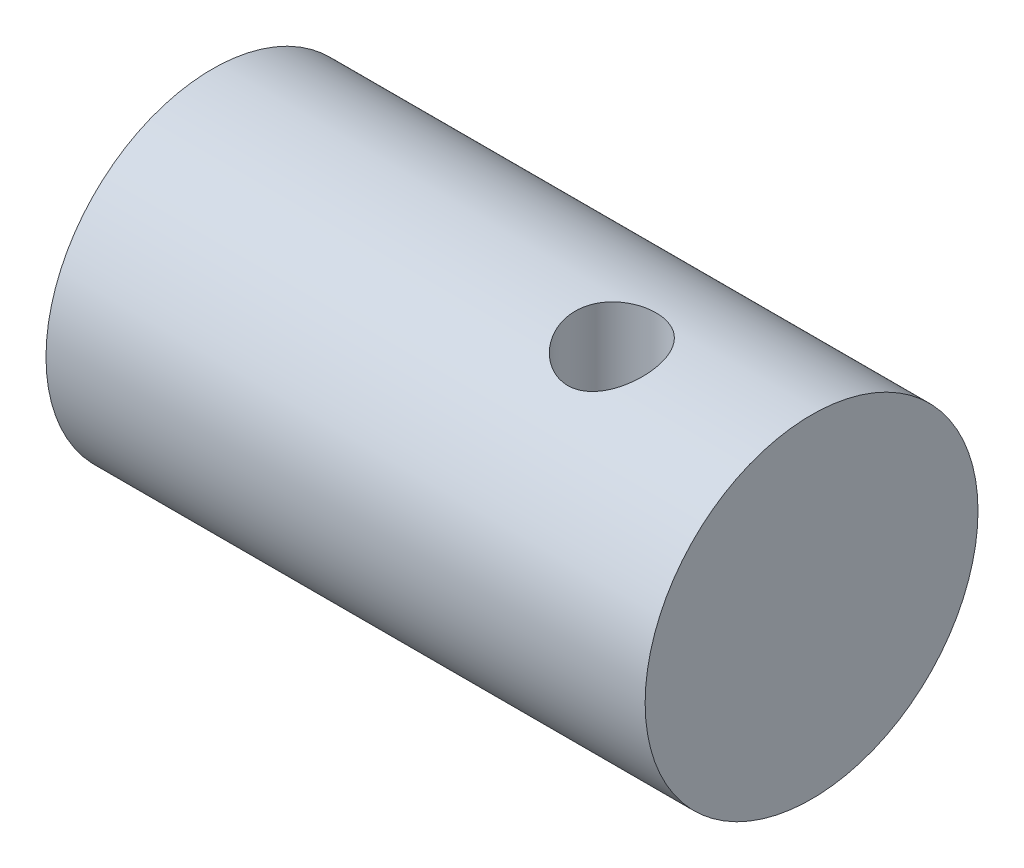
ISO-10303-21;
HEADER;
FILE_DESCRIPTION(('STEP AP214'),'2;1');
FILE_NAME('part.step','',(''),(''),'','','');
FILE_SCHEMA(('AUTOMOTIVE_DESIGN { 1 0 10303 214 1 1 1 1 }'));
ENDSEC;
DATA;
#1=APPLICATION_CONTEXT('core data for automotive mechanical design processes');
#2=APPLICATION_PROTOCOL_DEFINITION('international standard','automotive_design',2000,#1);
#3=PRODUCT_CONTEXT('',#1,'mechanical');
#4=PRODUCT('Part','Part','',(#3));
#5=PRODUCT_RELATED_PRODUCT_CATEGORY('part','',(#4));
#6=PRODUCT_DEFINITION_FORMATION('','',#4);
#7=PRODUCT_DEFINITION_CONTEXT('part definition',#1,'design');
#8=PRODUCT_DEFINITION('design','',#6,#7);
#9=PRODUCT_DEFINITION_SHAPE('','',#8);
#10=(LENGTH_UNIT() NAMED_UNIT(*) SI_UNIT(.MILLI.,.METRE.));
#11=(NAMED_UNIT(*) PLANE_ANGLE_UNIT() SI_UNIT($,.RADIAN.));
#12=(NAMED_UNIT(*) SI_UNIT($,.STERADIAN.) SOLID_ANGLE_UNIT());
#13=UNCERTAINTY_MEASURE_WITH_UNIT(LENGTH_MEASURE(1.E-05),#10,'distance_accuracy_value','');
#14=(GEOMETRIC_REPRESENTATION_CONTEXT(3) GLOBAL_UNCERTAINTY_ASSIGNED_CONTEXT((#13)) GLOBAL_UNIT_ASSIGNED_CONTEXT((#10,
#11,#12)) REPRESENTATION_CONTEXT('',''));
#15=CARTESIAN_POINT('',(0.,0.,0.));
#16=DIRECTION('',(0.,0.,1.));
#17=DIRECTION('',(1.,0.,0.));
#18=AXIS2_PLACEMENT_3D('',#15,#16,#17);
#19=CARTESIAN_POINT('',(0.,0.,0.));
#20=DIRECTION('',(-1.,0.,0.));
#21=DIRECTION('',(0.,0.,1.));
#22=AXIS2_PLACEMENT_3D('',#19,#20,#21);
#23=PLANE('',#22);
#24=CARTESIAN_POINT('',(0.,0.,0.));
#25=DIRECTION('',(-1.,0.,0.));
#26=DIRECTION('',(0.,0.,1.));
#27=AXIS2_PLACEMENT_3D('',#24,#25,#26);
#28=CIRCLE('',#27,15.875);
#29=CARTESIAN_POINT('',(0.,0.,15.875));
#30=VERTEX_POINT('',#29);
#31=EDGE_CURVE('E10',#30,#30,#28,.T.);
#32=ORIENTED_EDGE('',*,*,#31,.F.);
#33=EDGE_LOOP('',(#32));
#34=FACE_BOUND('',#33,.T.);
#35=ADVANCED_FACE('F29',(#34),#23,.F.);
#36=CARTESIAN_POINT('',(0.,0.,0.));
#37=DIRECTION('',(-1.,0.,0.));
#38=DIRECTION('',(0.,0.,1.));
#39=AXIS2_PLACEMENT_3D('',#36,#37,#38);
#40=CYLINDRICAL_SURFACE('',#39,15.875);
#41=CARTESIAN_POINT('',(-18.6494195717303,-15.875,0.));
#42=CARTESIAN_POINT('',(-18.8247307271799,-15.8749980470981,0.153198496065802));
#43=CARTESIAN_POINT('',(-18.987363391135,-15.8727779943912,0.320984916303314));
#44=CARTESIAN_POINT('',(-19.2826641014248,-15.8614077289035,0.680991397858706));
#45=CARTESIAN_POINT('',(-19.4153246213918,-15.8522557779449,0.873217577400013));
#46=CARTESIAN_POINT('',(-19.6469879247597,-15.8248830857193,1.27652039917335));
#47=CARTESIAN_POINT('',(-19.7459771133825,-15.8066586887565,1.4876046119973));
#48=CARTESIAN_POINT('',(-19.9076228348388,-15.7597203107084,1.92211926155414));
#49=CARTESIAN_POINT('',(-19.9702841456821,-15.73100770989,2.14554807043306));
#50=CARTESIAN_POINT('',(-20.0577654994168,-15.6628924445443,2.5963435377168));
#51=CARTESIAN_POINT('',(-20.0828590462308,-15.6235695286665,2.82366942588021));
#52=CARTESIAN_POINT('',(-20.0962656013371,-15.5347299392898,3.27738575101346));
#53=CARTESIAN_POINT('',(-20.0845741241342,-15.4852120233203,3.50377607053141));
#54=CARTESIAN_POINT('',(-20.0250083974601,-15.3762241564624,3.95506346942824));
#55=CARTESIAN_POINT('',(-19.9762771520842,-15.3165448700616,4.17979592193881));
#56=CARTESIAN_POINT('',(-19.8438292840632,-15.1905624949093,4.61673181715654));
#57=CARTESIAN_POINT('',(-19.760102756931,-15.1242575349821,4.82893169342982));
#58=CARTESIAN_POINT('',(-19.5545527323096,-14.9842601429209,5.24776465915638));
#59=CARTESIAN_POINT('',(-19.430842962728,-14.9103619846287,5.45340472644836));
#60=CARTESIAN_POINT('',(-19.1503777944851,-14.762863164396,5.84093940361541));
#61=CARTESIAN_POINT('',(-18.9936083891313,-14.6892626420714,6.02282389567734));
#62=CARTESIAN_POINT('',(-18.6440829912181,-14.5446367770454,6.36433336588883));
#63=CARTESIAN_POINT('',(-18.4502595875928,-14.4737917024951,6.52295656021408));
#64=CARTESIAN_POINT('',(-18.1390366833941,-14.3760962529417,6.73420722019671));
#65=CARTESIAN_POINT('',(-18.0318239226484,-14.3449467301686,6.800202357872));
#66=CARTESIAN_POINT('',(-17.8111855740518,-14.2862427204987,6.9226796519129));
#67=CARTESIAN_POINT('',(-17.6977633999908,-14.2586862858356,6.97916696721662));
#68=CARTESIAN_POINT('',(-17.4715546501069,-14.209227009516,7.07929741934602));
#69=CARTESIAN_POINT('',(-17.3590447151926,-14.1871039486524,7.12345757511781));
#70=CARTESIAN_POINT('',(-17.1299840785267,-14.1473331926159,7.20211996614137));
#71=CARTESIAN_POINT('',(-17.013435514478,-14.1296831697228,7.23662722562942));
#72=CARTESIAN_POINT('',(-16.7772478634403,-14.0993595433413,7.29553185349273));
#73=CARTESIAN_POINT('',(-16.6576106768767,-14.0866829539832,7.31993528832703));
#74=CARTESIAN_POINT('',(-16.4162354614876,-14.0666797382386,7.35830265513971));
#75=CARTESIAN_POINT('',(-16.2944976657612,-14.0593525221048,7.37226773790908));
#76=CARTESIAN_POINT('',(-16.063224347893,-14.050766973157,7.38861584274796));
#77=CARTESIAN_POINT('',(-15.9537850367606,-14.0489405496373,7.39208324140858));
#78=CARTESIAN_POINT('',(-15.7349482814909,-14.0497765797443,7.39049419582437));
#79=CARTESIAN_POINT('',(-15.625550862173,-14.0524404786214,7.38543500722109));
#80=CARTESIAN_POINT('',(-15.4077259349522,-14.0621915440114,7.3668518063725));
#81=CARTESIAN_POINT('',(-15.2992979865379,-14.0692765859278,7.3533318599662));
#82=CARTESIAN_POINT('',(-15.0841522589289,-14.0876827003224,7.31800563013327));
#83=CARTESIAN_POINT('',(-14.9774351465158,-14.0990053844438,7.29619619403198));
#84=CARTESIAN_POINT('',(-14.6683232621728,-14.1380233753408,7.22046698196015));
#85=CARTESIAN_POINT('',(-14.4691834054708,-14.1711551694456,7.15554227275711));
#86=CARTESIAN_POINT('',(-14.0848220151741,-14.2495287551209,6.9981577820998));
#87=CARTESIAN_POINT('',(-13.8996040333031,-14.2947736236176,6.90569100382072));
#88=CARTESIAN_POINT('',(-13.5331085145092,-14.397904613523,6.68816003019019));
#89=CARTESIAN_POINT('',(-13.3531691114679,-14.4564844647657,6.56117071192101));
#90=CARTESIAN_POINT('',(-13.0163695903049,-14.5799155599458,6.28211444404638));
#91=CARTESIAN_POINT('',(-12.8595205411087,-14.644769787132,6.13003554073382));
#92=CARTESIAN_POINT('',(-12.5570061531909,-14.7836233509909,5.7877023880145));
#93=CARTESIAN_POINT('',(-12.4140578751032,-14.8578859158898,5.59514597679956));
#94=CARTESIAN_POINT('',(-12.1625261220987,-15.0048462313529,5.18816189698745));
#95=CARTESIAN_POINT('',(-12.0539522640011,-15.0775435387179,4.97372812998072));
#96=CARTESIAN_POINT('',(-11.8712566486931,-15.2197542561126,4.52028598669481));
#97=CARTESIAN_POINT('',(-11.7984357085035,-15.2890746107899,4.28068902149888));
#98=CARTESIAN_POINT('',(-11.6961609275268,-15.418059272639,3.78990133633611));
#99=CARTESIAN_POINT('',(-11.6666934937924,-15.4777266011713,3.53871427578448));
#100=CARTESIAN_POINT('',(-11.6537012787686,-15.5824574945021,3.04365541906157));
#101=CARTESIAN_POINT('',(-11.6682126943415,-15.6280479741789,2.79994783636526));
#102=CARTESIAN_POINT('',(-11.7396519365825,-15.7069375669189,2.31680710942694));
#103=CARTESIAN_POINT('',(-11.7965657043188,-15.7402407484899,2.07737257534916));
#104=CARTESIAN_POINT('',(-11.9476369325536,-15.7933672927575,1.62319565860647));
#105=CARTESIAN_POINT('',(-12.0396729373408,-15.813808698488,1.40781698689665));
#106=CARTESIAN_POINT('',(-12.2584885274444,-15.8451579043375,0.994751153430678));
#107=CARTESIAN_POINT('',(-12.3852661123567,-15.8560662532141,0.797062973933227));
#108=CARTESIAN_POINT('',(-12.6683560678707,-15.8703120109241,0.427447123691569));
#109=CARTESIAN_POINT('',(-12.824312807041,-15.8737348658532,0.255249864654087));
#110=CARTESIAN_POINT('',(-13.162371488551,-15.8756724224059,-0.0612475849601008));
#111=CARTESIAN_POINT('',(-13.3444753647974,-15.8741867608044,-0.205545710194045));
#112=CARTESIAN_POINT('',(-13.732767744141,-15.8687476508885,-0.464245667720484));
#113=CARTESIAN_POINT('',(-13.939277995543,-15.8647573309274,-0.578163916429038));
#114=CARTESIAN_POINT('',(-14.3683751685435,-15.8566052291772,-0.770041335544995));
#115=CARTESIAN_POINT('',(-14.5909625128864,-15.8524434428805,-0.847999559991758));
#116=CARTESIAN_POINT('',(-15.0480080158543,-15.8456770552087,-0.966293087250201));
#117=CARTESIAN_POINT('',(-15.2825520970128,-15.8430862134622,-1.00629763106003));
#118=CARTESIAN_POINT('',(-15.7550589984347,-15.8404916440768,-1.04635777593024));
#119=CARTESIAN_POINT('',(-15.9930220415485,-15.8404880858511,-1.04641076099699));
#120=CARTESIAN_POINT('',(-16.4651666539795,-15.843066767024,-1.00659969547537));
#121=CARTESIAN_POINT('',(-16.6993537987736,-15.8456447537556,-0.966801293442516));
#122=CARTESIAN_POINT('',(-17.1576633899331,-15.8524164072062,-0.848527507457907));
#123=CARTESIAN_POINT('',(-17.3817892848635,-15.8566095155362,-0.770065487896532));
#124=CARTESIAN_POINT('',(-17.7884029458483,-15.8643323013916,-0.588057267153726));
#125=CARTESIAN_POINT('',(-17.9726955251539,-15.8678822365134,-0.488515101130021));
#126=CARTESIAN_POINT('',(-18.3245356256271,-15.873216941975,-0.26323149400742));
#127=CARTESIAN_POINT('',(-18.4920835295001,-15.8750017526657,-0.137490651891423));
#128=CARTESIAN_POINT('',(-18.6494195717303,-15.875,0.));
#129=B_SPLINE_CURVE_WITH_KNOTS('',3,(#41,#42,#43,#44,#45,#46,#47,#48,#49,#50,#51,#52,#53,#54,
#55,#56,#57,#58,#59,#60,#61,#62,#63,#64,#65,#66,#67,#68,#69,#70,#71,#72,#73,#74,#75,#76,#77,#78,
#79,#80,#81,#82,#83,#84,#85,#86,#87,#88,#89,#90,#91,#92,#93,#94,#95,#96,#97,#98,#99,#100,#101,
#102,#103,#104,#105,#106,#107,#108,#109,#110,#111,#112,#113,#114,#115,#116,#117,#118,#119,#120,
#121,#122,#123,#124,#125,#126,#127,#128),.UNSPECIFIED.,.T.,.F.,(4,2,2,2,2,2,2,2,2,2,2,2,2,2,2,2,
2,2,2,2,2,2,2,2,2,2,2,2,2,2,2,2,2,2,2,2,2,2,2,2,2,2,2,4),(0.,0.697719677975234,1.3956143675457,
2.09379049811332,2.79187478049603,3.48485166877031,4.17791306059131,4.8875173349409,
5.59732258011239,6.34725832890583,7.09751245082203,7.87402315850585,8.26265688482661,
8.65107905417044,9.01919919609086,9.38712737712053,9.75483432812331,10.122500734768,
10.4506134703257,10.7788318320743,11.1068925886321,11.435078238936,12.0682705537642,
12.7016238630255,13.3824936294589,14.0636887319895,14.8134855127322,15.5634918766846,
16.3390689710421,17.1144028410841,17.8556331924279,18.5966178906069,19.2985416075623,
20.000424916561,20.6942535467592,21.388133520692,22.0924758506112,22.7968367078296,
23.5072810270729,24.2177718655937,24.9270942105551,25.6361715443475,26.2623665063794,
26.8885471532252),.UNSPECIFIED.);
#130=CARTESIAN_POINT('',(-18.6494195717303,-15.875,0.));
#131=VERTEX_POINT('',#130);
#132=EDGE_CURVE('E64',#131,#131,#129,.T.);
#133=ORIENTED_EDGE('',*,*,#132,.T.);
#134=EDGE_LOOP('',(#133));
#135=FACE_BOUND('',#134,.T.);
#136=CARTESIAN_POINT('',(-15.875,14.0493000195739,7.3914));
#137=CARTESIAN_POINT('',(-15.985142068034,14.0492955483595,7.39140494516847));
#138=CARTESIAN_POINT('',(-16.0952416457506,14.0515734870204,7.38708258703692));
#139=CARTESIAN_POINT('',(-16.3146140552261,14.0606143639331,7.36986134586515));
#140=CARTESIAN_POINT('',(-16.4238867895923,14.0673778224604,7.35696146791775));
#141=CARTESIAN_POINT('',(-16.64077955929,14.0852267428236,7.32273049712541));
#142=CARTESIAN_POINT('',(-16.748399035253,14.0963136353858,7.30139661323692));
#143=CARTESIAN_POINT('',(-16.9612026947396,14.1225291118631,7.25055906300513));
#144=CARTESIAN_POINT('',(-17.0663858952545,14.1376592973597,7.22105215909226));
#145=CARTESIAN_POINT('',(-17.3763808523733,14.1884748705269,7.12098611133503));
#146=CARTESIAN_POINT('',(-17.5766529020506,14.22967371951,7.03871807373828));
#147=CARTESIAN_POINT('',(-17.9600876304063,14.3233602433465,6.84604881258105));
#148=CARTESIAN_POINT('',(-18.1432466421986,14.3758503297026,6.73564157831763));
#149=CARTESIAN_POINT('',(-18.5001258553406,14.4919749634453,6.48219593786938));
#150=CARTESIAN_POINT('',(-18.6725468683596,14.5561001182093,6.33755298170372));
#151=CARTESIAN_POINT('',(-18.9914951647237,14.6887241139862,6.02378819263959));
#152=CARTESIAN_POINT('',(-19.1380118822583,14.7572247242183,5.85465642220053));
#153=CARTESIAN_POINT('',(-19.4145756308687,14.9009933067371,5.47904985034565));
#154=CARTESIAN_POINT('',(-19.541894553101,14.9763077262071,5.27057499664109));
#155=CARTESIAN_POINT('',(-19.7591331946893,15.122985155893,4.83363541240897));
#156=CARTESIAN_POINT('',(-19.8490474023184,15.1943475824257,4.60516774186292));
#157=CARTESIAN_POINT('',(-19.988915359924,15.3299087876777,4.13166676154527));
#158=CARTESIAN_POINT('',(-20.0384826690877,15.394033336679,3.88649707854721));
#159=CARTESIAN_POINT('',(-20.0934132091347,15.5112157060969,3.38867176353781));
#160=CARTESIAN_POINT('',(-20.0987941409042,15.5642779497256,3.13601916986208));
#161=CARTESIAN_POINT('',(-20.0648125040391,15.6549522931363,2.64518740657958));
#162=CARTESIAN_POINT('',(-20.0278628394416,15.6932467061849,2.40696703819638));
#163=CARTESIAN_POINT('',(-19.9133105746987,15.7579292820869,1.9388388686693));
#164=CARTESIAN_POINT('',(-19.8357181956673,15.7843204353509,1.70892899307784));
#165=CARTESIAN_POINT('',(-19.6460374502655,15.8251765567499,1.27474075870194));
#166=CARTESIAN_POINT('',(-19.5356026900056,15.8401118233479,1.06978163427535));
#167=CARTESIAN_POINT('',(-19.282281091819,15.8616059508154,0.680529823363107));
#168=CARTESIAN_POINT('',(-19.1393944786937,15.8681648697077,0.49623699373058));
#169=CARTESIAN_POINT('',(-18.8253126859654,15.8751800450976,0.153804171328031));
#170=CARTESIAN_POINT('',(-18.6541428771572,15.8756417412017,-0.00435900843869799));
#171=CARTESIAN_POINT('',(-18.2881344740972,15.8729903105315,-0.290366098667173));
#172=CARTESIAN_POINT('',(-18.093294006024,15.8698769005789,-0.418207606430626));
#173=CARTESIAN_POINT('',(-17.6820133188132,15.8624216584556,-0.641855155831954));
#174=CARTESIAN_POINT('',(-17.4652797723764,15.8580611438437,-0.737121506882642));
#175=CARTESIAN_POINT('',(-17.0189278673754,15.8502124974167,-0.890110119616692));
#176=CARTESIAN_POINT('',(-16.7893093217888,15.8467243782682,-0.947831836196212));
#177=CARTESIAN_POINT('',(-16.3225077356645,15.8419687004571,-1.02428155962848));
#178=CARTESIAN_POINT('',(-16.0852937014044,15.8407118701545,-1.04282125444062));
#179=CARTESIAN_POINT('',(-15.6111230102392,15.8409098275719,-1.03980850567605));
#180=CARTESIAN_POINT('',(-15.3741663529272,15.8423646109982,-1.01825612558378));
#181=CARTESIAN_POINT('',(-14.9077246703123,15.8474492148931,-0.935765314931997));
#182=CARTESIAN_POINT('',(-14.6782257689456,15.8510747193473,-0.874905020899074));
#183=CARTESIAN_POINT('',(-14.2326713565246,15.8590623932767,-0.715599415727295));
#184=CARTESIAN_POINT('',(-14.0166164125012,15.863424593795,-0.617152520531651));
#185=CARTESIAN_POINT('',(-13.6036071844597,15.8707492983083,-0.38519832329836));
#186=CARTESIAN_POINT('',(-13.4066930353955,15.8737089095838,-0.251619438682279));
#187=CARTESIAN_POINT('',(-13.0380745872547,15.8756299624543,0.0467262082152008));
#188=CARTESIAN_POINT('',(-12.8663694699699,15.8745915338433,0.211491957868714));
#189=CARTESIAN_POINT('',(-12.5538481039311,15.8658723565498,0.566616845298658));
#190=CARTESIAN_POINT('',(-12.4128937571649,15.8582221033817,0.756855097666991));
#191=CARTESIAN_POINT('',(-12.1649584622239,15.8339954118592,1.15778560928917));
#192=CARTESIAN_POINT('',(-12.0579722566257,15.8174203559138,1.36847469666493));
#193=CARTESIAN_POINT('',(-11.8822917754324,15.7740553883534,1.80030639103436));
#194=CARTESIAN_POINT('',(-11.8130138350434,15.7474326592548,2.02122860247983));
#195=CARTESIAN_POINT('',(-11.7116180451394,15.6833220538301,2.46989132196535));
#196=CARTESIAN_POINT('',(-11.679499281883,15.645834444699,2.69763166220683));
#197=CARTESIAN_POINT('',(-11.6524754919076,15.5603813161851,3.15340225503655));
#198=CARTESIAN_POINT('',(-11.6575853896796,15.5124116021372,3.38143258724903));
#199=CARTESIAN_POINT('',(-11.7038969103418,15.4073902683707,3.83163557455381));
#200=CARTESIAN_POINT('',(-11.7451052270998,15.3503369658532,4.05380713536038));
#201=CARTESIAN_POINT('',(-11.864016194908,15.2268883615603,4.49580542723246));
#202=CARTESIAN_POINT('',(-11.9431316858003,15.160207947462,4.71517129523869));
#203=CARTESIAN_POINT('',(-12.1356418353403,15.0225600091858,5.1368852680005));
#204=CARTESIAN_POINT('',(-12.2490485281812,14.9515909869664,5.33922736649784));
#205=CARTESIAN_POINT('',(-12.514604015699,14.8050803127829,5.73340324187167));
#206=CARTESIAN_POINT('',(-12.6685832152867,14.729507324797,5.92399286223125));
#207=CARTESIAN_POINT('',(-13.0084120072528,14.582697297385,6.27671040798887));
#208=CARTESIAN_POINT('',(-13.1942742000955,14.5114619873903,6.43882702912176));
#209=CARTESIAN_POINT('',(-13.4941637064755,14.4119737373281,6.65711059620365));
#210=CARTESIAN_POINT('',(-13.5979819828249,14.3799546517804,6.72588961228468));
#211=CARTESIAN_POINT('',(-13.8119861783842,14.3191712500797,6.85434133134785));
#212=CARTESIAN_POINT('',(-13.9221690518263,14.2904053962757,6.91401834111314));
#213=CARTESIAN_POINT('',(-14.1480892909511,14.236878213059,7.02357793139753));
#214=CARTESIAN_POINT('',(-14.2638206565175,14.2121126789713,7.07347080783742));
#215=CARTESIAN_POINT('',(-14.5000360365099,14.1672433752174,7.16291391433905));
#216=CARTESIAN_POINT('',(-14.6205186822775,14.1471382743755,7.2024670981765));
#217=CARTESIAN_POINT('',(-14.925791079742,14.1035697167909,7.28754311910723));
#218=CARTESIAN_POINT('',(-15.1129709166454,14.08334621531,7.32637737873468));
#219=CARTESIAN_POINT('',(-15.4918109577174,14.0562173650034,7.37829743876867));
#220=CARTESIAN_POINT('',(-15.6834697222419,14.0493077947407,7.39139140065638));
#221=CARTESIAN_POINT('',(-15.875,14.0493000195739,7.3914));
#222=B_SPLINE_CURVE_WITH_KNOTS('',3,(#136,#137,#138,#139,#140,#141,#142,#143,#144,#145,#146,
#147,#148,#149,#150,#151,#152,#153,#154,#155,#156,#157,#158,#159,#160,#161,#162,#163,#164,#165,
#166,#167,#168,#169,#170,#171,#172,#173,#174,#175,#176,#177,#178,#179,#180,#181,#182,#183,#184,
#185,#186,#187,#188,#189,#190,#191,#192,#193,#194,#195,#196,#197,#198,#199,#200,#201,#202,#203,
#204,#205,#206,#207,#208,#209,#210,#211,#212,#213,#214,#215,#216,#217,#218,#219,#220,#221),
.UNSPECIFIED.,.T.,.F.,(4,2,2,2,2,2,2,2,2,2,2,2,2,2,2,2,2,2,2,2,2,2,2,2,2,2,2,2,2,2,2,2,2,2,2,2,
2,2,2,2,2,2,4),(0.,0.33024455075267,0.660527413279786,0.990919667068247,1.32144298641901,
1.97943346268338,2.63756460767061,3.33670256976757,4.03612504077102,4.79945507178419,
5.56289754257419,6.33356892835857,7.10393157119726,7.83247752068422,8.56084033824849,
9.25740980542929,9.95397444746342,10.6499176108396,11.3459159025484,12.0529421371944,
12.7599786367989,13.4704055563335,14.1808313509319,14.889849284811,15.5988971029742,
16.3094009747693,17.019881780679,17.7271030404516,18.4342147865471,19.1300455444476,
19.8258591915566,20.5219517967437,21.2181735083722,21.9426428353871,22.6673667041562,
23.4331353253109,24.1992072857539,24.5845324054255,24.9696746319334,25.3544093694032,
25.7390340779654,26.3134911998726,26.8877661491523),.UNSPECIFIED.);
#223=CARTESIAN_POINT('',(-15.875,14.0493000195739,7.3914));
#224=VERTEX_POINT('',#223);
#225=EDGE_CURVE('E69',#224,#224,#222,.T.);
#226=ORIENTED_EDGE('',*,*,#225,.T.);
#227=EDGE_LOOP('',(#226));
#228=FACE_BOUND('',#227,.T.);
#229=CARTESIAN_POINT('',(-57.15,0.,0.));
#230=DIRECTION('',(-1.,0.,0.));
#231=DIRECTION('',(0.,0.,1.));
#232=AXIS2_PLACEMENT_3D('',#229,#230,#231);
#233=CIRCLE('',#232,15.875);
#234=CARTESIAN_POINT('',(-57.15,0.,15.875));
#235=VERTEX_POINT('',#234);
#236=EDGE_CURVE('E40',#235,#235,#233,.T.);
#237=ORIENTED_EDGE('',*,*,#236,.F.);
#238=EDGE_LOOP('',(#237));
#239=FACE_BOUND('',#238,.T.);
#240=ORIENTED_EDGE('',*,*,#31,.T.);
#241=EDGE_LOOP('',(#240));
#242=FACE_BOUND('',#241,.T.);
#243=ADVANCED_FACE('F72',(#135,#228,#239,#242),#40,.T.);
#244=CARTESIAN_POINT('',(-57.15,15.875,0.));
#245=DIRECTION('',(1.,0.,0.));
#246=DIRECTION('',(0.,0.,-1.));
#247=AXIS2_PLACEMENT_3D('',#244,#245,#246);
#248=PLANE('',#247);
#249=CARTESIAN_POINT('',(-57.15,0.,0.));
#250=DIRECTION('',(-1.,0.,0.));
#251=DIRECTION('',(0.,0.,1.));
#252=AXIS2_PLACEMENT_3D('',#249,#250,#251);
#253=CIRCLE('',#252,12.7);
#254=CARTESIAN_POINT('',(-57.15,0.,12.7));
#255=VERTEX_POINT('',#254);
#256=EDGE_CURVE('E44',#255,#255,#253,.T.);
#257=ORIENTED_EDGE('',*,*,#256,.F.);
#258=EDGE_LOOP('',(#257));
#259=FACE_BOUND('',#258,.T.);
#260=ORIENTED_EDGE('',*,*,#236,.T.);
#261=EDGE_LOOP('',(#260));
#262=FACE_BOUND('',#261,.T.);
#263=ADVANCED_FACE('F104',(#259,#262),#248,.F.);
#264=CARTESIAN_POINT('',(0.,0.,0.));
#265=DIRECTION('',(-1.,0.,0.));
#266=DIRECTION('',(0.,0.,1.));
#267=AXIS2_PLACEMENT_3D('',#264,#265,#266);
#268=CYLINDRICAL_SURFACE('',#267,12.7);
#269=CARTESIAN_POINT('',(-50.8,0.,0.));
#270=DIRECTION('',(-1.,0.,0.));
#271=DIRECTION('',(0.,0.,1.));
#272=AXIS2_PLACEMENT_3D('',#269,#270,#271);
#273=CIRCLE('',#272,12.7);
#274=CARTESIAN_POINT('',(-50.8,0.,12.7));
#275=VERTEX_POINT('',#274);
#276=EDGE_CURVE('E49',#275,#275,#273,.T.);
#277=ORIENTED_EDGE('',*,*,#276,.F.);
#278=EDGE_LOOP('',(#277));
#279=FACE_BOUND('',#278,.T.);
#280=ORIENTED_EDGE('',*,*,#256,.T.);
#281=EDGE_LOOP('',(#280));
#282=FACE_BOUND('',#281,.T.);
#283=ADVANCED_FACE('F101',(#279,#282),#268,.F.);
#284=CARTESIAN_POINT('',(-50.8,12.7,0.));
#285=DIRECTION('',(1.,0.,0.));
#286=DIRECTION('',(0.,0.,-1.));
#287=AXIS2_PLACEMENT_3D('',#284,#285,#286);
#288=PLANE('',#287);
#289=CARTESIAN_POINT('',(-50.8,0.,0.));
#290=DIRECTION('',(-1.,0.,0.));
#291=DIRECTION('',(0.,0.,1.));
#292=AXIS2_PLACEMENT_3D('',#289,#290,#291);
#293=CIRCLE('',#292,10.3124);
#294=CARTESIAN_POINT('',(-50.8,0.,10.3124));
#295=VERTEX_POINT('',#294);
#296=EDGE_CURVE('E52',#295,#295,#293,.T.);
#297=ORIENTED_EDGE('',*,*,#296,.F.);
#298=EDGE_LOOP('',(#297));
#299=FACE_BOUND('',#298,.T.);
#300=ORIENTED_EDGE('',*,*,#276,.T.);
#301=EDGE_LOOP('',(#300));
#302=FACE_BOUND('',#301,.T.);
#303=ADVANCED_FACE('F97',(#299,#302),#288,.F.);
#304=CARTESIAN_POINT('',(0.,0.,0.));
#305=DIRECTION('',(-1.,0.,0.));
#306=DIRECTION('',(0.,0.,1.));
#307=AXIS2_PLACEMENT_3D('',#304,#305,#306);
#308=CYLINDRICAL_SURFACE('',#307,10.3124);
#309=CARTESIAN_POINT('',(-31.75,0.,0.));
#310=DIRECTION('',(-1.,0.,0.));
#311=DIRECTION('',(0.,0.,1.));
#312=AXIS2_PLACEMENT_3D('',#309,#310,#311);
#313=CIRCLE('',#312,10.3124);
#314=CARTESIAN_POINT('',(-31.75,0.,10.3124));
#315=VERTEX_POINT('',#314);
#316=EDGE_CURVE('E55',#315,#315,#313,.T.);
#317=ORIENTED_EDGE('',*,*,#316,.F.);
#318=EDGE_LOOP('',(#317));
#319=FACE_BOUND('',#318,.T.);
#320=ORIENTED_EDGE('',*,*,#296,.T.);
#321=EDGE_LOOP('',(#320));
#322=FACE_BOUND('',#321,.T.);
#323=ADVANCED_FACE('F93',(#319,#322),#308,.F.);
#324=CARTESIAN_POINT('',(-31.75,10.3124,0.));
#325=DIRECTION('',(1.,0.,0.));
#326=DIRECTION('',(0.,0.,-1.));
#327=AXIS2_PLACEMENT_3D('',#324,#325,#326);
#328=PLANE('',#327);
#329=CARTESIAN_POINT('',(-31.75,0.,0.));
#330=DIRECTION('',(-1.,0.,0.));
#331=DIRECTION('',(0.,0.,1.));
#332=AXIS2_PLACEMENT_3D('',#329,#330,#331);
#333=CIRCLE('',#332,6.5405);
#334=CARTESIAN_POINT('',(-31.75,0.,6.5405));
#335=VERTEX_POINT('',#334);
#336=EDGE_CURVE('E58',#335,#335,#333,.T.);
#337=ORIENTED_EDGE('',*,*,#336,.F.);
#338=EDGE_LOOP('',(#337));
#339=FACE_BOUND('',#338,.T.);
#340=ORIENTED_EDGE('',*,*,#316,.T.);
#341=EDGE_LOOP('',(#340));
#342=FACE_BOUND('',#341,.T.);
#343=ADVANCED_FACE('F89',(#339,#342),#328,.F.);
#344=CARTESIAN_POINT('',(0.,0.,0.));
#345=DIRECTION('',(-1.,0.,0.));
#346=DIRECTION('',(0.,0.,1.));
#347=AXIS2_PLACEMENT_3D('',#344,#345,#346);
#348=CYLINDRICAL_SURFACE('',#347,6.5405);
#349=CARTESIAN_POINT('',(-13.3350317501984,0.,6.5405));
#350=CARTESIAN_POINT('',(-13.3350353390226,0.135417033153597,6.54050141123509));
#351=CARTESIAN_POINT('',(-13.3294168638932,0.270822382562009,6.53628396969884));
#352=CARTESIAN_POINT('',(-13.3074647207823,0.540289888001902,6.51954453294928));
#353=CARTESIAN_POINT('',(-13.2911257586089,0.674351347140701,6.50701843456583));
#354=CARTESIAN_POINT('',(-13.2490121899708,0.940450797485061,6.47392819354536));
#355=CARTESIAN_POINT('',(-13.2232029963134,1.07247949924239,6.45333456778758));
#356=CARTESIAN_POINT('',(-13.1639619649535,1.33339775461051,6.40451578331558));
#357=CARTESIAN_POINT('',(-13.1305264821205,1.46228577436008,6.37628697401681));
#358=CARTESIAN_POINT('',(-13.0435188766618,1.76702185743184,6.299944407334));
#359=CARTESIAN_POINT('',(-12.9872191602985,1.94122579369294,6.24838422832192));
#360=CARTESIAN_POINT('',(-12.8680171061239,2.28275933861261,6.13186256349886));
#361=CARTESIAN_POINT('',(-12.8051115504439,2.45008554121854,6.06689453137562));
#362=CARTESIAN_POINT('',(-12.6763393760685,2.77828531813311,5.92379766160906));
#363=CARTESIAN_POINT('',(-12.6104667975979,2.93914455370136,5.84564138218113));
#364=CARTESIAN_POINT('',(-12.4790462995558,3.25400353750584,5.67640174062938));
#365=CARTESIAN_POINT('',(-12.4134983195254,3.40800460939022,5.58532088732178));
#366=CARTESIAN_POINT('',(-12.282896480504,3.71502444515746,5.38623644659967));
#367=CARTESIAN_POINT('',(-12.2179697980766,3.86775163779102,5.27769746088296));
#368=CARTESIAN_POINT('',(-12.0944142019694,4.16494322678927,5.04646711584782));
#369=CARTESIAN_POINT('',(-12.0357869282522,4.30940546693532,4.92377208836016));
#370=CARTESIAN_POINT('',(-11.9281010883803,4.5884130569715,4.66483506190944));
#371=CARTESIAN_POINT('',(-11.8790056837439,4.72299528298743,4.52864841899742));
#372=CARTESIAN_POINT('',(-11.7933268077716,4.98134838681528,4.24279815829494));
#373=CARTESIAN_POINT('',(-11.7567327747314,5.10512832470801,4.0931460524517));
#374=CARTESIAN_POINT('',(-11.7110059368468,5.29265436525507,3.84441337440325));
#375=CARTESIAN_POINT('',(-11.6967507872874,5.36046538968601,3.74930266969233));
#376=CARTESIAN_POINT('',(-11.6746291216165,5.4911977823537,3.55507734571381));
#377=CARTESIAN_POINT('',(-11.6667605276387,5.55412073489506,3.45596403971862));
#378=CARTESIAN_POINT('',(-11.6581379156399,5.67464208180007,3.25428533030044));
#379=CARTESIAN_POINT('',(-11.6573814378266,5.7322423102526,3.15172113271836));
#380=CARTESIAN_POINT('',(-11.6636590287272,5.84174248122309,2.94380485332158));
#381=CARTESIAN_POINT('',(-11.6706933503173,5.89364223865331,2.83845268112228));
#382=CARTESIAN_POINT('',(-11.6932327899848,5.99175745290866,2.62504765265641));
#383=CARTESIAN_POINT('',(-11.7088005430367,6.03792774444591,2.51698053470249));
#384=CARTESIAN_POINT('',(-11.7489221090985,6.12388070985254,2.29996622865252));
#385=CARTESIAN_POINT('',(-11.7734759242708,6.16366338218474,2.19101904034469));
#386=CARTESIAN_POINT('',(-11.8318549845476,6.23672516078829,1.97346471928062));
#387=CARTESIAN_POINT('',(-11.8656771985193,6.2700063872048,1.86485748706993));
#388=CARTESIAN_POINT('',(-11.9426882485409,6.3301501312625,1.64920237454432));
#389=CARTESIAN_POINT('',(-11.9858762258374,6.35701323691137,1.54215435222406));
#390=CARTESIAN_POINT('',(-12.0763210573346,6.40200639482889,1.34230652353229));
#391=CARTESIAN_POINT('',(-12.1226319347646,6.42076689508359,1.24921837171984));
#392=CARTESIAN_POINT('',(-12.2224176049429,6.45370236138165,1.06607909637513));
#393=CARTESIAN_POINT('',(-12.2758948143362,6.46787577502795,0.976029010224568));
#394=CARTESIAN_POINT('',(-12.3896761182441,6.49202272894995,0.799806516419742));
#395=CARTESIAN_POINT('',(-12.4499780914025,6.50199756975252,0.713632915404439));
#396=CARTESIAN_POINT('',(-12.577064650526,6.51823328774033,0.545791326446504));
#397=CARTESIAN_POINT('',(-12.6438517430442,6.52449272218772,0.464125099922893));
#398=CARTESIAN_POINT('',(-12.7836408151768,6.53383350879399,0.305730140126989));
#399=CARTESIAN_POINT('',(-12.8566581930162,6.53690672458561,0.229014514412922));
#400=CARTESIAN_POINT('',(-13.0082961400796,6.54041311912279,0.0812542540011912));
#401=CARTESIAN_POINT('',(-13.08691868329,6.54084536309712,0.0102116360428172));
#402=CARTESIAN_POINT('',(-13.3304594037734,6.53904421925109,-0.193693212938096));
#403=CARTESIAN_POINT('',(-13.5031408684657,6.53371744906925,-0.317434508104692));
#404=CARTESIAN_POINT('',(-13.8795852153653,6.51873253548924,-0.546394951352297));
#405=CARTESIAN_POINT('',(-14.0847323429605,6.50875892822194,-0.649306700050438));
#406=CARTESIAN_POINT('',(-14.5090506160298,6.4893961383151,-0.820566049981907));
#407=CARTESIAN_POINT('',(-14.7282239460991,6.480007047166,-0.88890825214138));
#408=CARTESIAN_POINT('',(-15.1830274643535,6.46520673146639,-0.99098768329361));
#409=CARTESIAN_POINT('',(-15.4189661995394,6.45995198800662,-1.02338113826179));
#410=CARTESIAN_POINT('',(-15.8929796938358,6.45599948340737,-1.04803349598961));
#411=CARTESIAN_POINT('',(-16.1310542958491,6.45730124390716,-1.04029532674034));
#412=CARTESIAN_POINT('',(-16.5995520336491,6.46591587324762,-0.985296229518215));
#413=CARTESIAN_POINT('',(-16.8300324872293,6.47315708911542,-0.938506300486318));
#414=CARTESIAN_POINT('',(-17.2800674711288,6.49082104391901,-0.807297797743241));
#415=CARTESIAN_POINT('',(-17.4996193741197,6.50124454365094,-0.72287022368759));
#416=CARTESIAN_POINT('',(-17.8170036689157,6.51586729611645,-0.569422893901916));
#417=CARTESIAN_POINT('',(-17.9213110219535,6.52059436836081,-0.513449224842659));
#418=CARTESIAN_POINT('',(-18.1248746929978,6.52896710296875,-0.392920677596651));
#419=CARTESIAN_POINT('',(-18.224132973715,6.53261318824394,-0.32836916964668));
#420=CARTESIAN_POINT('',(-18.4169384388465,6.53806843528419,-0.191094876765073));
#421=CARTESIAN_POINT('',(-18.5104832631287,6.53987684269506,-0.118368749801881));
#422=CARTESIAN_POINT('',(-18.6910954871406,6.5408554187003,0.034675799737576));
#423=CARTESIAN_POINT('',(-18.7781657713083,6.54002676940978,0.114990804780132));
#424=CARTESIAN_POINT('',(-18.9441768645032,6.53496036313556,0.28158653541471));
#425=CARTESIAN_POINT('',(-19.0232038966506,6.53076432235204,0.367782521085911));
#426=CARTESIAN_POINT('',(-19.1736664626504,6.51826419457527,0.546228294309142));
#427=CARTESIAN_POINT('',(-19.2451054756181,6.50996200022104,0.638475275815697));
#428=CARTESIAN_POINT('',(-19.3798351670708,6.48855940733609,0.828154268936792));
#429=CARTESIAN_POINT('',(-19.4431297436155,6.47546131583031,0.925583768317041));
#430=CARTESIAN_POINT('',(-19.5611330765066,6.44386551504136,1.12467359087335));
#431=CARTESIAN_POINT('',(-19.615842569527,6.42536826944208,1.22633355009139));
#432=CARTESIAN_POINT('',(-19.7123708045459,6.38419957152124,1.42462882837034));
#433=CARTESIAN_POINT('',(-19.7548659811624,6.36197250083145,1.52102791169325));
#434=CARTESIAN_POINT('',(-19.8321594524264,6.31228746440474,1.71558997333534));
#435=CARTESIAN_POINT('',(-19.8669551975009,6.28482777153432,1.81375352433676));
#436=CARTESIAN_POINT('',(-19.928808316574,6.22457822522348,2.01081476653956));
#437=CARTESIAN_POINT('',(-19.9558697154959,6.19179115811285,2.10971204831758));
#438=CARTESIAN_POINT('',(-20.0024242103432,6.12086962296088,2.30740754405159));
#439=CARTESIAN_POINT('',(-20.0219144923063,6.08273317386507,2.40620570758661));
#440=CARTESIAN_POINT('',(-20.0530783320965,6.00253041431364,2.59968849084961));
#441=CARTESIAN_POINT('',(-20.0649803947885,5.96062729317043,2.6944041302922));
#442=CARTESIAN_POINT('',(-20.0822821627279,5.87211252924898,2.88222830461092));
#443=CARTESIAN_POINT('',(-20.0876793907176,5.82549909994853,2.97533621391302));
#444=CARTESIAN_POINT('',(-20.0947164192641,5.67893540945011,3.25131994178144));
#445=CARTESIAN_POINT('',(-20.0872167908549,5.57222004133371,3.43095661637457));
#446=CARTESIAN_POINT('',(-20.0571315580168,5.37798627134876,3.72511703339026));
#447=CARTESIAN_POINT('',(-20.039792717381,5.29441896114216,3.84290623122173));
#448=CARTESIAN_POINT('',(-19.9965780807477,5.12050531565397,4.07175821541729));
#449=CARTESIAN_POINT('',(-19.9706994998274,5.0301567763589,4.18281879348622));
#450=CARTESIAN_POINT('',(-19.8822019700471,4.74975089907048,4.50546388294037));
#451=CARTESIAN_POINT('',(-19.8087531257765,4.55050507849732,4.70625395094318));
#452=CARTESIAN_POINT('',(-19.6700782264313,4.19999076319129,5.01739363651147));
#453=CARTESIAN_POINT('',(-19.609799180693,4.05388958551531,5.13606693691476));
#454=CARTESIAN_POINT('',(-19.483695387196,3.75360405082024,5.35943705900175));
#455=CARTESIAN_POINT('',(-19.4178712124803,3.59942052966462,5.46413532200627));
#456=CARTESIAN_POINT('',(-19.2835441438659,3.28329922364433,5.65974574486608));
#457=CARTESIAN_POINT('',(-19.2150369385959,3.12134885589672,5.75063446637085));
#458=CARTESIAN_POINT('',(-19.0786485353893,2.7901505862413,5.91841585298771));
#459=CARTESIAN_POINT('',(-19.0107671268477,2.62090525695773,5.9953134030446));
#460=CARTESIAN_POINT('',(-18.8968616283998,2.32110625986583,6.1163155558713));
#461=CARTESIAN_POINT('',(-18.8498309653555,2.19225177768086,6.16369957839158));
#462=CARTESIAN_POINT('',(-18.7598538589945,1.93045896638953,6.25063959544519));
#463=CARTESIAN_POINT('',(-18.7169086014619,1.79751946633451,6.29019332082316));
#464=CARTESIAN_POINT('',(-18.6372888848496,1.528103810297,6.36100389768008));
#465=CARTESIAN_POINT('',(-18.6005936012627,1.39164121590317,6.39228850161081));
#466=CARTESIAN_POINT('',(-18.5355638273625,1.11513205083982,6.44627250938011));
#467=CARTESIAN_POINT('',(-18.5072225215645,0.975088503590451,6.46897891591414));
#468=CARTESIAN_POINT('',(-18.4656425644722,0.720194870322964,6.5017333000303));
#469=CARTESIAN_POINT('',(-18.450522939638,0.605860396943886,6.51339911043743));
#470=CARTESIAN_POINT('',(-18.4279408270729,0.375982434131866,6.53070092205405));
#471=CARTESIAN_POINT('',(-18.4204771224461,0.260439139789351,6.53633788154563));
#472=CARTESIAN_POINT('',(-18.4137015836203,0.0290528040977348,6.54145839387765));
#473=CARTESIAN_POINT('',(-18.4143841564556,-0.0867899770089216,6.54094616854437));
#474=CARTESIAN_POINT('',(-18.4238405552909,-0.317954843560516,6.53379064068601));
#475=CARTESIAN_POINT('',(-18.4326149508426,-0.433276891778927,6.52714690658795));
#476=CARTESIAN_POINT('',(-18.4576062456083,-0.661873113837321,6.50792915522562));
#477=CARTESIAN_POINT('',(-18.4737769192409,-0.77515553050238,6.49539195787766));
#478=CARTESIAN_POINT('',(-18.5126176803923,-0.999835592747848,6.46462222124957));
#479=CARTESIAN_POINT('',(-18.5352906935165,-1.11123236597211,6.44638711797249));
#480=CARTESIAN_POINT('',(-18.6115006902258,-1.44247673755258,6.38341486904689));
#481=CARTESIAN_POINT('',(-18.6731718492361,-1.65893109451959,6.33044990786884));
#482=CARTESIAN_POINT('',(-18.8000055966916,-2.05293305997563,6.21289435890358));
#483=CARTESIAN_POINT('',(-18.863578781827,-2.23179390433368,6.15083092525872));
#484=CARTESIAN_POINT('',(-18.9955112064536,-2.58210720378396,6.01218338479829));
#485=CARTESIAN_POINT('',(-19.0638735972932,-2.75355465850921,5.9355896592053));
#486=CARTESIAN_POINT('',(-19.2015156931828,-3.08909810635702,5.76808368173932));
#487=CARTESIAN_POINT('',(-19.2707960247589,-3.25318870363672,5.67716113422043));
#488=CARTESIAN_POINT('',(-19.4068547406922,-3.5735859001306,5.48114113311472));
#489=CARTESIAN_POINT('',(-19.4736342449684,-3.72989599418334,5.37605012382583));
#490=CARTESIAN_POINT('',(-19.6384892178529,-4.12185700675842,5.08694290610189));
#491=CARTESIAN_POINT('',(-19.7325496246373,-4.35160054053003,4.89222718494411));
#492=CARTESIAN_POINT('',(-19.8541024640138,-4.67741388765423,4.5741621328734));
#493=CARTESIAN_POINT('',(-19.8913457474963,-4.78282170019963,4.46388935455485));
#494=CARTESIAN_POINT('',(-19.9577661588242,-4.98676222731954,4.23483416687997));
#495=CARTESIAN_POINT('',(-19.9869455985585,-5.08529690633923,4.11605420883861));
#496=CARTESIAN_POINT('',(-20.0297925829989,-5.25225657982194,3.89948543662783));
#497=CARTESIAN_POINT('',(-20.0454950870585,-5.32230573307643,3.80334487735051));
#498=CARTESIAN_POINT('',(-20.0703989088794,-5.45740343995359,3.60681241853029));
#499=CARTESIAN_POINT('',(-20.079601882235,-5.5224532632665,3.50642160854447));
#500=CARTESIAN_POINT('',(-20.0907335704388,-5.6471124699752,3.3019087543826));
#501=CARTESIAN_POINT('',(-20.0926621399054,-5.70672174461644,3.19778663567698));
#502=CARTESIAN_POINT('',(-20.0885111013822,-5.82003585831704,2.98658238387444));
#503=CARTESIAN_POINT('',(-20.0824355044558,-5.87374364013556,2.87950175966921));
#504=CARTESIAN_POINT('',(-20.0615505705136,-5.97532868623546,2.6623433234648));
#505=CARTESIAN_POINT('',(-20.046669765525,-6.02315432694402,2.55224809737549));
#506=CARTESIAN_POINT('',(-20.0075951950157,-6.11217604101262,2.3310210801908));
#507=CARTESIAN_POINT('',(-19.9834013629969,-6.15337206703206,2.21988928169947));
#508=CARTESIAN_POINT('',(-19.9253816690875,-6.22899115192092,1.99788763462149));
#509=CARTESIAN_POINT('',(-19.8915600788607,-6.2634172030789,1.88701769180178));
#510=CARTESIAN_POINT('',(-19.8141673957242,-6.32557756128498,1.66682133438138));
#511=CARTESIAN_POINT('',(-19.7705973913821,-6.35331261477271,1.55749474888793));
#512=CARTESIAN_POINT('',(-19.6798344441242,-6.39931356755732,1.35511104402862));
#513=CARTESIAN_POINT('',(-19.6337619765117,-6.4183274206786,1.26171849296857));
#514=CARTESIAN_POINT('',(-19.5344135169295,-6.45173588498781,1.07794633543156));
#515=CARTESIAN_POINT('',(-19.4811351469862,-6.46612896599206,0.987567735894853));
#516=CARTESIAN_POINT('',(-19.3677106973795,-6.49067958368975,0.810673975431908));
#517=CARTESIAN_POINT('',(-19.3075668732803,-6.50083850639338,0.724157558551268));
#518=CARTESIAN_POINT('',(-19.1807546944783,-6.51740738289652,0.555621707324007));
#519=CARTESIAN_POINT('',(-19.1140838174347,-6.52381588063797,0.47360403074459));
#520=CARTESIAN_POINT('',(-18.9746687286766,-6.53340891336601,0.314711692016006));
#521=CARTESIAN_POINT('',(-18.9019249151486,-6.53659365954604,0.237836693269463));
#522=CARTESIAN_POINT('',(-18.7508228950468,-6.54030429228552,0.0897315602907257));
#523=CARTESIAN_POINT('',(-18.6724627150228,-6.54082923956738,0.0185034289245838));
#524=CARTESIAN_POINT('',(-18.4296909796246,-6.539275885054,-0.185993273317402));
#525=CARTESIAN_POINT('',(-18.2574975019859,-6.53407408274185,-0.310177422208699));
#526=CARTESIAN_POINT('',(-17.8820122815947,-6.51926292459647,-0.540143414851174));
#527=CARTESIAN_POINT('',(-17.6773318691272,-6.50933126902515,-0.643626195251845));
#528=CARTESIAN_POINT('',(-17.2538590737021,-6.4899649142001,-0.816120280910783));
#529=CARTESIAN_POINT('',(-17.0350643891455,-6.48053029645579,-0.88512594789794));
#530=CARTESIAN_POINT('',(-16.5807610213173,-6.46556732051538,-0.988673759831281));
#531=CARTESIAN_POINT('',(-16.3449334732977,-6.46019620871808,-1.02184801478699));
#532=CARTESIAN_POINT('',(-15.8710065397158,-6.45599523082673,-1.04806978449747));
#533=CARTESIAN_POINT('',(-15.6329073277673,-6.45716486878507,-1.04112034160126));
#534=CARTESIAN_POINT('',(-15.1642102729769,-6.46555036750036,-0.98767060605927));
#535=CARTESIAN_POINT('',(-14.9335570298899,-6.47269460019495,-0.941638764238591));
#536=CARTESIAN_POINT('',(-14.4830566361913,-6.49023889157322,-0.811905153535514));
#537=CARTESIAN_POINT('',(-14.2632120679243,-6.50063972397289,-0.728194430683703));
#538=CARTESIAN_POINT('',(-13.9453294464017,-6.51530461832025,-0.575792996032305));
#539=CARTESIAN_POINT('',(-13.8408559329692,-6.52005829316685,-0.520172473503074));
#540=CARTESIAN_POINT('',(-13.6369303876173,-6.52851341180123,-0.400336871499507));
#541=CARTESIAN_POINT('',(-13.5374764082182,-6.53221526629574,-0.336125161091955));
#542=CARTESIAN_POINT('',(-13.3442495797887,-6.53781349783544,-0.199513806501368));
#543=CARTESIAN_POINT('',(-13.2504791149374,-6.53970912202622,-0.127110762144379));
#544=CARTESIAN_POINT('',(-13.0693865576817,-6.54089473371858,0.0253081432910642));
#545=CARTESIAN_POINT('',(-12.9820616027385,-6.54018588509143,0.105320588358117));
#546=CARTESIAN_POINT('',(-12.815459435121,-6.53538853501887,0.271396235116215));
#547=CARTESIAN_POINT('',(-12.7361010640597,-6.53133908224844,0.357379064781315));
#548=CARTESIAN_POINT('',(-12.5849602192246,-6.51915675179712,0.535436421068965));
#549=CARTESIAN_POINT('',(-12.5131742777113,-6.51102575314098,0.627508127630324));
#550=CARTESIAN_POINT('',(-12.3777387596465,-6.48998605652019,0.816878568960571));
#551=CARTESIAN_POINT('',(-12.3140853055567,-6.47707964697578,0.914174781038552));
#552=CARTESIAN_POINT('',(-12.1953573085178,-6.44588241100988,1.11304317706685));
#553=CARTESIAN_POINT('',(-12.1402820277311,-6.42759204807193,1.21461499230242));
#554=CARTESIAN_POINT('',(-12.0430363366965,-6.38682326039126,1.41281521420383));
#555=CARTESIAN_POINT('',(-12.0001918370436,-6.36478704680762,1.50920461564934));
#556=CARTESIAN_POINT('',(-11.9222093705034,-6.31548255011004,1.70378837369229));
#557=CARTESIAN_POINT('',(-11.8870739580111,-6.2882125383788,1.80198331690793));
#558=CARTESIAN_POINT('',(-11.8245574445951,-6.22833584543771,1.99914514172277));
#559=CARTESIAN_POINT('',(-11.7971722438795,-6.19573200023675,2.09811158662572));
#560=CARTESIAN_POINT('',(-11.749990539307,-6.1251656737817,2.29598007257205));
#561=CARTESIAN_POINT('',(-11.7301968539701,-6.08720120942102,2.39488207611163));
#562=CARTESIAN_POINT('',(-11.6984785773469,-6.00736868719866,2.588485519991));
#563=CARTESIAN_POINT('',(-11.6863165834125,-5.96567008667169,2.68321812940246));
#564=CARTESIAN_POINT('',(-11.6685055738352,-5.87755910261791,2.87110301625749));
#565=CARTESIAN_POINT('',(-11.6628590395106,-5.8311449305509,2.96425467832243));
#566=CARTESIAN_POINT('',(-11.65509498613,-5.68516775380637,3.2404042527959));
#567=CARTESIAN_POINT('',(-11.6621373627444,-5.57882821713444,3.42019856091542));
#568=CARTESIAN_POINT('',(-11.6914796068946,-5.38537246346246,3.71441766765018));
#569=CARTESIAN_POINT('',(-11.7084932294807,-5.30223318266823,3.83210535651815));
#570=CARTESIAN_POINT('',(-11.7510582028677,-5.12918552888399,4.06080694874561));
#571=CARTESIAN_POINT('',(-11.7766123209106,-5.03927496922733,4.17181867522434));
#572=CARTESIAN_POINT('',(-11.8641508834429,-4.76019182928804,4.49439228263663));
#573=CARTESIAN_POINT('',(-11.9369799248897,-4.5618410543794,4.69523144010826));
#574=CARTESIAN_POINT('',(-12.07473089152,-4.21276366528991,5.00666307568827));
#575=CARTESIAN_POINT('',(-12.1346842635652,-4.06719280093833,5.12552771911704));
#576=CARTESIAN_POINT('',(-12.2602047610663,-3.76797781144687,5.34933087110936));
#577=CARTESIAN_POINT('',(-12.325771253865,-3.61433459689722,5.45427094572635));
#578=CARTESIAN_POINT('',(-12.4596649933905,-3.2993241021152,5.65040755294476));
#579=CARTESIAN_POINT('',(-12.5279964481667,-3.13794497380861,5.74158205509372));
#580=CARTESIAN_POINT('',(-12.6641496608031,-2.8079296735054,5.90999018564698));
#581=CARTESIAN_POINT('',(-12.7319715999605,-2.63929624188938,5.98722902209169));
#582=CARTESIAN_POINT('',(-12.8454623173,-2.341766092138,6.10839773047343));
#583=CARTESIAN_POINT('',(-12.8921196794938,-2.21460525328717,6.15566171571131));
#584=CARTESIAN_POINT('',(-12.9815353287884,-1.95639886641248,6.24253515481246));
#585=CARTESIAN_POINT('',(-13.0242933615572,-1.82535306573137,6.28214410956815));
#586=CARTESIAN_POINT('',(-13.1434885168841,-1.42722027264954,6.38875720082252));
#587=CARTESIAN_POINT('',(-13.2113462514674,-1.15392569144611,6.444047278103));
#588=CARTESIAN_POINT('',(-13.2834813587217,-0.731253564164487,6.50111400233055));
#589=CARTESIAN_POINT('',(-13.3026333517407,-0.586063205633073,6.51583905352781));
#590=CARTESIAN_POINT('',(-13.3284036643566,-0.29391007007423,6.53552900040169));
#591=CARTESIAN_POINT('',(-13.3350278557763,-0.146948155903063,6.54049846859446));
#592=CARTESIAN_POINT('',(-13.3350317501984,0.,6.5405));
#593=B_SPLINE_CURVE_WITH_KNOTS('',3,(#349,#350,#351,#352,#353,#354,#355,#356,#357,#358,#359,
#360,#361,#362,#363,#364,#365,#366,#367,#368,#369,#370,#371,#372,#373,#374,#375,#376,#377,#378,
#379,#380,#381,#382,#383,#384,#385,#386,#387,#388,#389,#390,#391,#392,#393,#394,#395,#396,#397,
#398,#399,#400,#401,#402,#403,#404,#405,#406,#407,#408,#409,#410,#411,#412,#413,#414,#415,#416,
#417,#418,#419,#420,#421,#422,#423,#424,#425,#426,#427,#428,#429,#430,#431,#432,#433,#434,#435,
#436,#437,#438,#439,#440,#441,#442,#443,#444,#445,#446,#447,#448,#449,#450,#451,#452,#453,#454,
#455,#456,#457,#458,#459,#460,#461,#462,#463,#464,#465,#466,#467,#468,#469,#470,#471,#472,#473,
#474,#475,#476,#477,#478,#479,#480,#481,#482,#483,#484,#485,#486,#487,#488,#489,#490,#491,#492,
#493,#494,#495,#496,#497,#498,#499,#500,#501,#502,#503,#504,#505,#506,#507,#508,#509,#510,#511,
#512,#513,#514,#515,#516,#517,#518,#519,#520,#521,#522,#523,#524,#525,#526,#527,#528,#529,#530,
#531,#532,#533,#534,#535,#536,#537,#538,#539,#540,#541,#542,#543,#544,#545,#546,#547,#548,#549,
#550,#551,#552,#553,#554,#555,#556,#557,#558,#559,#560,#561,#562,#563,#564,#565,#566,#567,#568,
#569,#570,#571,#572,#573,#574,#575,#576,#577,#578,#579,#580,#581,#582,#583,#584,#585,#586,#587,
#588,#589,#590,#591,#592),.UNSPECIFIED.,.T.,.F.,(4,2,2,2,2,2,2,2,2,2,2,2,2,2,2,2,2,2,2,2,2,2,2,
2,2,2,2,2,2,2,2,2,2,2,2,2,2,2,2,2,2,2,2,2,2,2,2,2,2,2,2,2,2,2,2,2,2,2,2,2,2,2,2,2,2,2,2,2,2,2,2,
2,2,2,2,2,2,2,2,2,2,2,2,2,2,2,2,2,2,2,2,2,2,2,2,2,2,2,2,2,2,2,2,2,2,2,2,2,2,2,2,2,2,2,2,2,2,2,2,
2,2,4),(0.,0.40605701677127,0.812314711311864,1.22007115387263,1.62802290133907,
2.19773496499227,2.76772584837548,3.33891771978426,3.90999886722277,4.50417429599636,
5.09850403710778,5.69048899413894,6.28197257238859,6.63470589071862,6.98732440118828,
7.33982095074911,7.69232894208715,8.04745966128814,8.40259046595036,8.75760526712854,
9.11258753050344,9.42915774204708,9.74583497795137,10.0624140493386,10.3791159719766,
10.6966246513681,11.0142457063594,11.6490834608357,12.3352646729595,13.0215530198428,
13.7327113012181,14.4438176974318,15.146469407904,15.8492892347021,16.2043566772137,
16.5592850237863,16.9143590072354,17.2692738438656,17.6198585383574,17.9702817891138,
18.3205366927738,18.6707615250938,18.9933591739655,19.3160634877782,19.6385995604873,
19.9612553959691,20.2736683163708,20.5862001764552,21.2109367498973,21.6467862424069,
22.0827780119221,22.9556841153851,23.5479778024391,24.140210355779,24.733437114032,
25.3264563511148,25.7615473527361,26.1967642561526,26.6305014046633,27.0638837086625,
27.4112612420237,27.7585835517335,28.1056674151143,28.452775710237,28.7977436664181,
29.1428670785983,29.8344588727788,30.432888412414,31.0317154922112,31.6309748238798,
32.2299625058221,33.1724612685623,33.6430937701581,34.1135912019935,34.4732312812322,
34.8327797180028,35.1923353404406,35.551710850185,35.9140440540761,36.2763798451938,
36.6385551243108,37.0006899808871,37.3178875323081,37.6351900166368,37.9523885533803,
38.2697101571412,38.5870109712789,38.9044238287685,39.5388414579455,40.2245431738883,
40.9103569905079,41.6215159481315,42.3326209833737,43.0353209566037,43.7381880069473,
44.0931993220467,44.4480718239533,44.803092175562,45.1579538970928,45.5087254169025,
45.8593355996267,46.2097779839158,46.5601902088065,46.8830584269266,47.2060334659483,
47.5288373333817,47.8517609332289,48.1640635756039,48.4764851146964,49.1009981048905,
49.535750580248,49.9706440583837,50.8413641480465,51.432530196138,52.0236297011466,
52.6156653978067,53.2074793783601,53.6375482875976,54.0676452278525,54.9236607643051,
55.3645012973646,55.8051351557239),.UNSPECIFIED.);
#594=CARTESIAN_POINT('',(-13.3350317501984,0.,6.5405));
#595=VERTEX_POINT('',#594);
#596=EDGE_CURVE('E32',#595,#595,#593,.T.);
#597=ORIENTED_EDGE('',*,*,#596,.T.);
#598=EDGE_LOOP('',(#597));
#599=FACE_BOUND('',#598,.T.);
#600=CARTESIAN_POINT('',(-5.08000000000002,0.,0.));
#601=DIRECTION('',(-1.,0.,0.));
#602=DIRECTION('',(0.,0.,1.));
#603=AXIS2_PLACEMENT_3D('',#600,#601,#602);
#604=CIRCLE('',#603,6.5405);
#605=CARTESIAN_POINT('',(-5.08000000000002,0.,6.5405));
#606=VERTEX_POINT('',#605);
#607=EDGE_CURVE('E61',#606,#606,#604,.T.);
#608=ORIENTED_EDGE('',*,*,#607,.F.);
#609=EDGE_LOOP('',(#608));
#610=FACE_BOUND('',#609,.T.);
#611=ORIENTED_EDGE('',*,*,#336,.T.);
#612=EDGE_LOOP('',(#611));
#613=FACE_BOUND('',#612,.T.);
#614=ADVANCED_FACE('F84',(#599,#610,#613),#348,.F.);
#615=CARTESIAN_POINT('',(-5.08000000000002,6.5405,0.));
#616=DIRECTION('',(1.,0.,0.));
#617=DIRECTION('',(0.,0.,-1.));
#618=AXIS2_PLACEMENT_3D('',#615,#616,#617);
#619=PLANE('',#618);
#620=ORIENTED_EDGE('',*,*,#607,.T.);
#621=EDGE_LOOP('',(#620));
#622=FACE_BOUND('',#621,.T.);
#623=ADVANCED_FACE('F79',(#622),#619,.F.);
#624=CARTESIAN_POINT('',(-15.875,-15.875,3.175));
#625=DIRECTION('',(0.,1.,0.));
#626=DIRECTION('',(0.,0.,1.));
#627=AXIS2_PLACEMENT_3D('',#624,#625,#626);
#628=CYLINDRICAL_SURFACE('',#627,4.2164);
#629=ORIENTED_EDGE('',*,*,#596,.F.);
#630=EDGE_LOOP('',(#629));
#631=FACE_BOUND('',#630,.T.);
#632=ORIENTED_EDGE('',*,*,#225,.F.);
#633=EDGE_LOOP('',(#632));
#634=FACE_BOUND('',#633,.T.);
#635=ORIENTED_EDGE('',*,*,#132,.F.);
#636=EDGE_LOOP('',(#635));
#637=FACE_BOUND('',#636,.T.);
#638=ADVANCED_FACE('F75',(#631,#634,#637),#628,.F.);
#639=CLOSED_SHELL('',(#35,#243,#263,#283,#303,#323,#343,#614,#623,#638));
#640=MANIFOLD_SOLID_BREP('B2',#639);
#641=ADVANCED_BREP_SHAPE_REPRESENTATION('',(#18,#640),#14);
#642=SHAPE_DEFINITION_REPRESENTATION(#9,#641);
ENDSEC;
END-ISO-10303-21;
